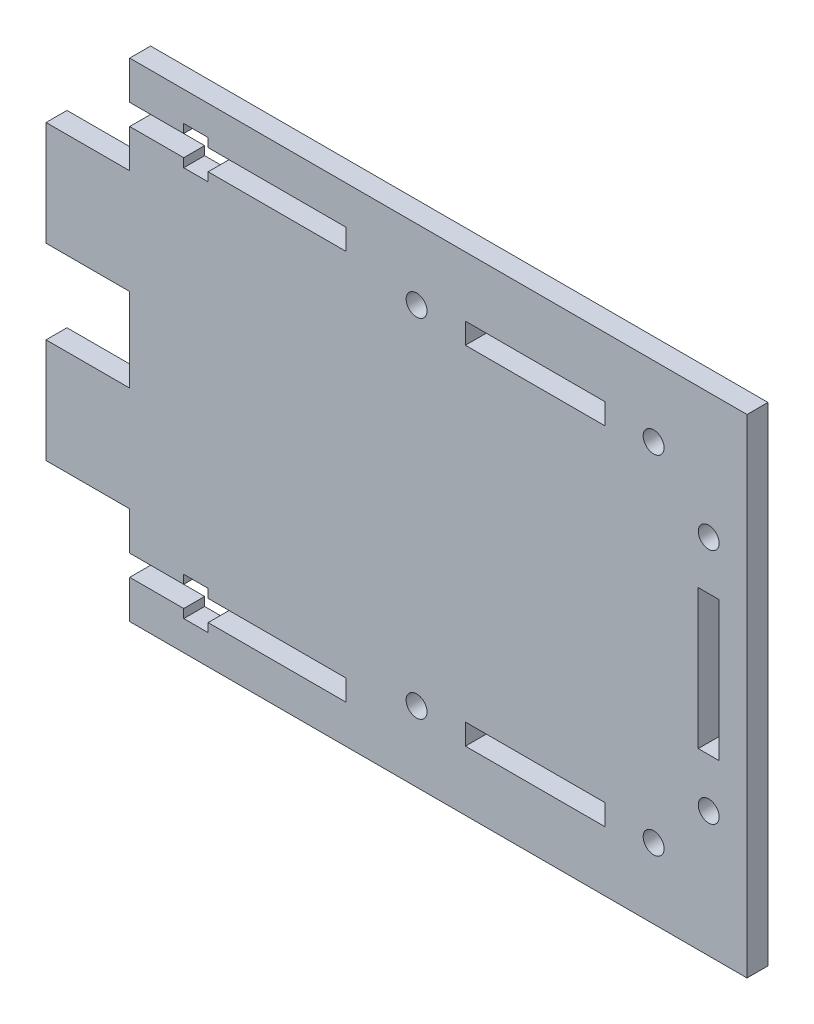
from build123d import *

# Parameters (mm, degrees)
SKETCH1_R           = 1.5
SKETCH1_W           = 20
SKETCH1_H           = 3
SKETCH1_W_2         = 3
SKETCH1_H_2         = 20
BOSS_EXTRUDE1_DEPTH = 3


with BuildPart() as part:
    # Sketch1 → Boss-Extrude1 (new body)
    with BuildSketch(Plane.XY):
        Polygon((-50.275, 21), (-50.275, 6), (-38.275, 6), (-38.275, -6), (-50.275, -6), (-50.275, -21), (-38.275, -21), (-38.275, -26.5), (-30.525, -26.5), (-30.525, -25.25), (-27.025, -25.25), (-27.025, -26.5), (-7.275, -26.5), (-7.275, -29.5), (-27.025, -29.5), (-27.025, -30.75), (-30.525, -30.75), (-30.525, -29.5), (-38.275, -29.5), (-38.275, -35), (50.275, -35), (50.275, 35), (-38.275, 35), (-38.275, 29.5), (-30.525, 29.5), (-30.525, 30.75), (-27.025, 30.75), (-27.025, 29.5), (-7.275, 29.5), (-7.275, 26.5), (-27.025, 26.5), (-27.025, 25.25), (-30.525, 25.25), (-30.525, 26.5), (-38.275, 26.5), (-38.275, 21), align=None)
        with Locations((36.875, 24.9)):
            Circle(SKETCH1_R, mode=Mode.SUBTRACT)
        with Locations((2.875, -24.9)):
            Circle(SKETCH1_R, mode=Mode.SUBTRACT)
        with Locations((19.875, -24.9)):
            Rectangle(SKETCH1_W, SKETCH1_H, mode=Mode.SUBTRACT)
        with Locations((36.875, -24.9)):
            Circle(SKETCH1_R, mode=Mode.SUBTRACT)
        with Locations((44.775, -17)):
            Circle(SKETCH1_R, mode=Mode.SUBTRACT)
        with Locations((44.775, 0)):
            Rectangle(SKETCH1_W_2, SKETCH1_H_2, mode=Mode.SUBTRACT)
        with Locations((44.775, 17)):
            Circle(SKETCH1_R, mode=Mode.SUBTRACT)
        with Locations((2.875, 24.9)):
            Circle(SKETCH1_R, mode=Mode.SUBTRACT)
        with Locations((19.875, 24.9)):
            Rectangle(SKETCH1_W, SKETCH1_H, mode=Mode.SUBTRACT)
    extrude(amount=BOSS_EXTRUDE1_DEPTH)


solid = part.part
